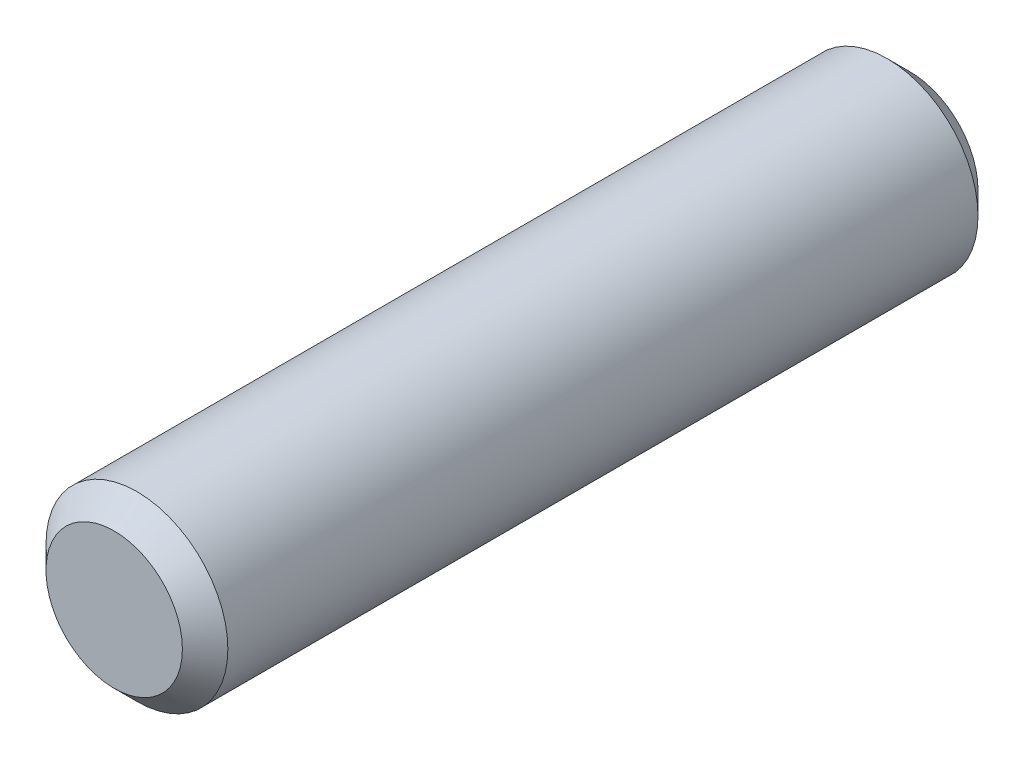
from build123d import *

# Parameters (mm, degrees)
ESQUISSE1_R        = 4
BOSS_EXTRU_1_DEPTH = 35
CHANFREIN1_SIZE    = 1


with BuildPart() as part:
    # Esquisse1 → Boss.-Extru.1 (new body)
    with BuildSketch(Plane.XY):
        Circle(ESQUISSE1_R)
    extrude(amount=BOSS_EXTRU_1_DEPTH)

    # Chanfrein1
    chanfrein1_edges = [part.edges().sort_by_distance(p)[0] for p in [
        (-4, 0, 0),
        (-4, 0, 35),
    ]]
    chamfer(chanfrein1_edges, length=CHANFREIN1_SIZE)


solid = part.part
